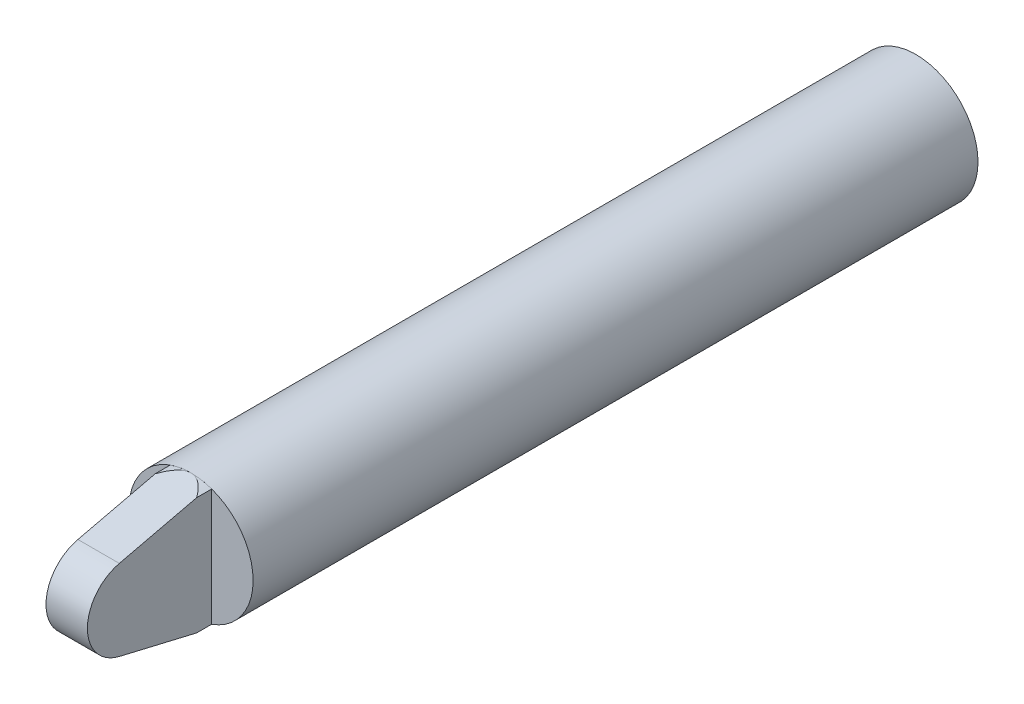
from build123d import *

# Parameters (mm, degrees)
SKIZZE1_R                       = 30
LINEAR_AUSTRAGEN1_DEPTH         = 350
LINEAR_AUSTRAGEN2_DEPTH         = 10
SKIZZE3_OUTSIDE_W               = 145.738
SKIZZE3_OUTSIDE_H               = 145.738
SKIZZE3_OUTSIDE_R               = 30
SCHNITT_LINEAR_AUSTRAGEN1_DEPTH = 413.18927691


with BuildPart() as part:
    # Skizze1 → Linear austragen1 (new body)
    with BuildSketch(Plane.XY):
        Circle(SKIZZE1_R)
    extrude(amount=LINEAR_AUSTRAGEN1_DEPTH)


with BuildPart() as body_2:
    # Skizze2 → Linear austragen2 (new, symmetric)
    with BuildSketch(Plane(origin=(0, 0, 0), x_dir=(0, 0, -1), z_dir=(1, 0, 0))):
        with BuildLine():
            Line((-350, 30), (-394.598181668, 19.464242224))
            ThreePointArc((-394.598181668, 19.464242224), (-410, 0), (-394.598181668, -19.464242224))
            Line((-394.598181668, -19.464242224), (-350, -30))
            Line((-350, -30), (-350, 30))
        make_face()
    extrude(amount=LINEAR_AUSTRAGEN2_DEPTH, both=True)

    # Skizze3 outside → Schnitt-Linear austragen1 (cut, through all)
    with BuildSketch(Plane(origin=(0, 0, 0), x_dir=(-1, 0, 0), z_dir=(0, 0, -1))):
        Rectangle(SKIZZE3_OUTSIDE_W, SKIZZE3_OUTSIDE_H)
        with Locations(Location((0, 0, 0), (0, 0, 180))):
            Circle(SKIZZE3_OUTSIDE_R, mode=Mode.SUBTRACT)
    extrude(amount=-SCHNITT_LINEAR_AUSTRAGEN1_DEPTH, mode=Mode.SUBTRACT)


solid = Compound([part.part, body_2.part])
